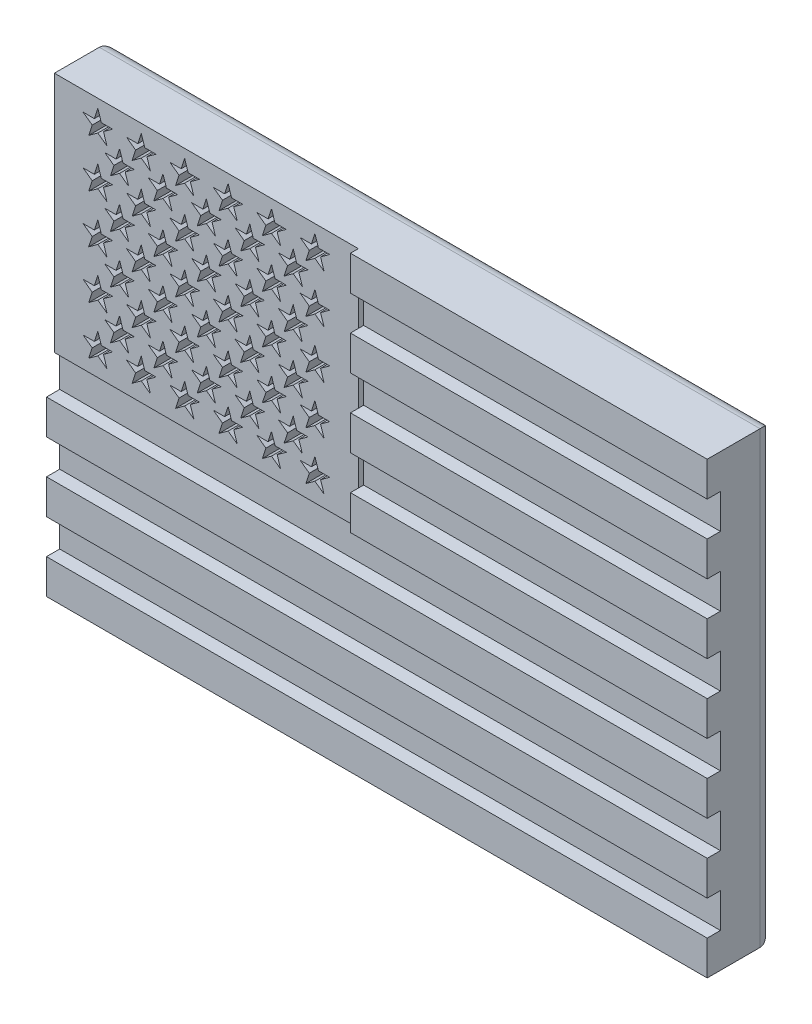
from build123d import *

# Parameters (mm, degrees)
SKETCH1_W           = 31.75
SKETCH1_H           = 21.59
BOSS_EXTRUDE1_DEPTH = 2.54
FILLET1_R           = 0.635
SKETCH2_W           = 17.145
SKETCH2_H           = 1.660769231
SKETCH2_H_2         = 1.66076923
SKETCH2_W_2         = 31.75
BOSS_EXTRUDE2_DEPTH = 0.635
SKETCH3_W           = 14.605
SKETCH3_H           = 11.625384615
BOSS_EXTRUDE3_DEPTH = 0.635
CUT_EXTRUDE1_DEPTH  = 1.905
CUT_EXTRUDE2_DEPTH  = 1.905
SKETCH6_W           = 14.605
SKETCH6_H           = 11.625384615
CUT_EXTRUDE3_DEPTH  = 0.381


with BuildPart() as part:
    # Sketch1 → Boss-Extrude1 (new body)
    with BuildSketch(Plane.XY):
        Rectangle(SKETCH1_W, SKETCH1_H)
    extrude(amount=BOSS_EXTRUDE1_DEPTH)

    # Fillet1
    fillet1_edges = [part.edges().sort_by_distance(p)[0] for p in [
        (0, -10.795, 0),
        (-15.875, 0, 0),
        (0, 10.795, 0),
        (15.875, 0, 0),
    ]]
    fillet(fillet1_edges, radius=FILLET1_R)

    # Sketch2 → Boss-Extrude2 (add)
    with BuildSketch(Plane.XY.offset(2.54)):
        with Locations((7.3025, 9.964615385)):
            Rectangle(SKETCH2_W, SKETCH2_H)
        with Locations((7.3025, 6.643076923)):
            Rectangle(SKETCH2_W, SKETCH2_H_2)
        with Locations((7.3025, 3.321538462)):
            Rectangle(SKETCH2_W, SKETCH2_H)
        with Locations((7.3025, 0)):
            Rectangle(SKETCH2_W, SKETCH2_H_2)
        with Locations((0, -3.321538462)):
            Rectangle(SKETCH2_W_2, SKETCH2_H)
        with Locations((0, -6.643076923)):
            Rectangle(SKETCH2_W_2, SKETCH2_H_2)
        with Locations((0, -9.964615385)):
            Rectangle(SKETCH2_W_2, SKETCH2_H)
    extrude(amount=BOSS_EXTRUDE2_DEPTH)

    # Sketch3 → Boss-Extrude3 (add)
    with BuildSketch(Plane.XY.offset(2.54)):
        with Locations((-8.5725, 4.982307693)):
            Rectangle(SKETCH3_W, SKETCH3_H)
    extrude(amount=BOSS_EXTRUDE3_DEPTH)

    # Sketch4 → Cut-Extrude1 (cut)
    with BuildSketch(Plane.XY.offset(3.175)):
        Polygon((-13.788571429, 10.378119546), (-13.955982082, 9.862882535), (-14.497734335, 9.862882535), (-14.059447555, 9.54444855), (-14.226858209, 9.029211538), (-13.788571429, 9.347645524), (-13.350284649, 9.029211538), (-13.517695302, 9.54444855), (-13.079408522, 9.862882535), (-13.621160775, 9.862882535), align=None)
        Polygon((-11.534732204, 9.862882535), (-11.702142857, 10.378119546), (-11.86955351, 9.862882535), (-12.411305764, 9.862882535), (-11.973018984, 9.54444855), (-12.140429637, 9.029211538), (-11.702142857, 9.347645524), (-11.263856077, 9.029211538), (-11.43126673, 9.54444855), (-10.99297995, 9.862882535), align=None)
        Polygon((-9.448303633, 9.862882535), (-9.615714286, 10.378119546), (-9.783124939, 9.862882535), (-10.324877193, 9.862882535), (-9.886590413, 9.54444855), (-10.054001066, 9.029211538), (-9.615714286, 9.347645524), (-9.177427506, 9.029211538), (-9.344838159, 9.54444855), (-8.906551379, 9.862882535), align=None)
        Polygon((-7.361875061, 9.862882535), (-7.529285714, 10.378119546), (-7.696696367, 9.862882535), (-8.238448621, 9.862882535), (-7.800161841, 9.54444855), (-7.967572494, 9.029211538), (-7.529285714, 9.347645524), (-7.090998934, 9.029211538), (-7.258409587, 9.54444855), (-6.820122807, 9.862882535), align=None)
        Polygon((-5.27544649, 9.862882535), (-5.442857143, 10.378119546), (-5.610267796, 9.862882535), (-6.15202005, 9.862882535), (-5.71373327, 9.54444855), (-5.881143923, 9.029211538), (-5.442857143, 9.347645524), (-5.004570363, 9.029211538), (-5.171981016, 9.54444855), (-4.733694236, 9.862882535), align=None)
        Polygon((-3.189017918, 9.862882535), (-3.356428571, 10.378119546), (-3.523839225, 9.862882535), (-4.065591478, 9.862882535), (-3.627304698, 9.54444855), (-3.794715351, 9.029211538), (-3.356428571, 9.347645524), (-2.918141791, 9.029211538), (-3.085552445, 9.54444855), (-2.647265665, 9.862882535), align=None)
        Polygon((-13.621160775, 7.544604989), (-13.788571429, 8.059842), (-13.955982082, 7.544604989), (-14.497734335, 7.544604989), (-14.059447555, 7.226171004), (-14.226858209, 6.710933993), (-13.788571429, 7.029367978), (-13.350284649, 6.710933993), (-13.517695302, 7.226171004), (-13.079408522, 7.544604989), align=None)
        Polygon((-11.534732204, 7.544604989), (-11.702142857, 8.059842), (-11.86955351, 7.544604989), (-12.411305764, 7.544604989), (-11.973018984, 7.226171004), (-12.140429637, 6.710933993), (-11.702142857, 7.029367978), (-11.263856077, 6.710933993), (-11.43126673, 7.226171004), (-10.99297995, 7.544604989), align=None)
        Polygon((-9.448303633, 7.544604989), (-9.615714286, 8.059842), (-9.783124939, 7.544604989), (-10.324877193, 7.544604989), (-9.886590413, 7.226171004), (-10.054001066, 6.710933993), (-9.615714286, 7.029367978), (-9.177427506, 6.710933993), (-9.344838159, 7.226171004), (-8.906551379, 7.544604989), align=None)
        Polygon((-7.361875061, 7.544604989), (-7.529285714, 8.059842), (-7.696696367, 7.544604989), (-8.238448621, 7.544604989), (-7.800161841, 7.226171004), (-7.967572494, 6.710933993), (-7.529285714, 7.029367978), (-7.090998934, 6.710933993), (-7.258409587, 7.226171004), (-6.820122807, 7.544604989), align=None)
        Polygon((-5.27544649, 7.544604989), (-5.442857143, 8.059842), (-5.610267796, 7.544604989), (-6.15202005, 7.544604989), (-5.71373327, 7.226171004), (-5.881143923, 6.710933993), (-5.442857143, 7.029367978), (-5.004570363, 6.710933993), (-5.171981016, 7.226171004), (-4.733694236, 7.544604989), align=None)
        Polygon((-3.189017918, 7.544604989), (-3.356428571, 8.059842), (-3.523839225, 7.544604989), (-4.065591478, 7.544604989), (-3.627304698, 7.226171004), (-3.794715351, 6.710933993), (-3.356428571, 7.029367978), (-2.918141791, 6.710933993), (-3.085552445, 7.226171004), (-2.647265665, 7.544604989), align=None)
        Polygon((-13.621160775, 5.226327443), (-13.788571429, 5.741564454), (-13.955982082, 5.226327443), (-14.497734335, 5.226327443), (-14.059447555, 4.907893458), (-14.226858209, 4.392656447), (-13.788571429, 4.711090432), (-13.350284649, 4.392656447), (-13.517695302, 4.907893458), (-13.079408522, 5.226327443), align=None)
        Polygon((-11.534732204, 5.226327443), (-11.702142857, 5.741564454), (-11.86955351, 5.226327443), (-12.411305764, 5.226327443), (-11.973018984, 4.907893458), (-12.140429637, 4.392656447), (-11.702142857, 4.711090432), (-11.263856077, 4.392656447), (-11.43126673, 4.907893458), (-10.99297995, 5.226327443), align=None)
        Polygon((-9.448303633, 5.226327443), (-9.615714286, 5.741564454), (-9.783124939, 5.226327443), (-10.324877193, 5.226327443), (-9.886590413, 4.907893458), (-10.054001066, 4.392656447), (-9.615714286, 4.711090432), (-9.177427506, 4.392656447), (-9.344838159, 4.907893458), (-8.906551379, 5.226327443), align=None)
        Polygon((-7.361875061, 5.226327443), (-7.529285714, 5.741564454), (-7.696696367, 5.226327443), (-8.238448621, 5.226327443), (-7.800161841, 4.907893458), (-7.967572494, 4.392656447), (-7.529285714, 4.711090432), (-7.090998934, 4.392656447), (-7.258409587, 4.907893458), (-6.820122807, 5.226327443), align=None)
        Polygon((-5.27544649, 5.226327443), (-5.442857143, 5.741564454), (-5.610267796, 5.226327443), (-6.15202005, 5.226327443), (-5.71373327, 4.907893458), (-5.881143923, 4.392656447), (-5.442857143, 4.711090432), (-5.004570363, 4.392656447), (-5.171981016, 4.907893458), (-4.733694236, 5.226327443), align=None)
        Polygon((-3.189017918, 5.226327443), (-3.356428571, 5.741564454), (-3.523839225, 5.226327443), (-4.065591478, 5.226327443), (-3.627304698, 4.907893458), (-3.794715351, 4.392656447), (-3.356428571, 4.711090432), (-2.918141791, 4.392656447), (-3.085552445, 4.907893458), (-2.647265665, 5.226327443), align=None)
        Polygon((-13.621160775, 2.908049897), (-13.788571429, 3.423286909), (-13.955982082, 2.908049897), (-14.497734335, 2.908049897), (-14.059447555, 2.589615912), (-14.226858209, 2.074378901), (-13.788571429, 2.392812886), (-13.350284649, 2.074378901), (-13.517695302, 2.589615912), (-13.079408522, 2.908049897), align=None)
        Polygon((-11.534732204, 2.908049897), (-11.702142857, 3.423286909), (-11.86955351, 2.908049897), (-12.411305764, 2.908049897), (-11.973018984, 2.589615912), (-12.140429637, 2.074378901), (-11.702142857, 2.392812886), (-11.263856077, 2.074378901), (-11.43126673, 2.589615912), (-10.99297995, 2.908049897), align=None)
        Polygon((-9.448303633, 2.908049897), (-9.615714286, 3.423286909), (-9.783124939, 2.908049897), (-10.324877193, 2.908049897), (-9.886590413, 2.589615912), (-10.054001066, 2.074378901), (-9.615714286, 2.392812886), (-9.177427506, 2.074378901), (-9.344838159, 2.589615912), (-8.906551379, 2.908049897), align=None)
        Polygon((-7.361875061, 2.908049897), (-7.529285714, 3.423286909), (-7.696696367, 2.908049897), (-8.238448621, 2.908049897), (-7.800161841, 2.589615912), (-7.967572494, 2.074378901), (-7.529285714, 2.392812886), (-7.090998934, 2.074378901), (-7.258409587, 2.589615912), (-6.820122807, 2.908049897), align=None)
        Polygon((-5.27544649, 2.908049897), (-5.442857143, 3.423286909), (-5.610267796, 2.908049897), (-6.15202005, 2.908049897), (-5.71373327, 2.589615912), (-5.881143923, 2.074378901), (-5.442857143, 2.392812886), (-5.004570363, 2.074378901), (-5.171981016, 2.589615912), (-4.733694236, 2.908049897), align=None)
        Polygon((-3.189017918, 2.908049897), (-3.356428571, 3.423286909), (-3.523839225, 2.908049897), (-4.065591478, 2.908049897), (-3.627304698, 2.589615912), (-3.794715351, 2.074378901), (-3.356428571, 2.392812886), (-2.918141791, 2.074378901), (-3.085552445, 2.589615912), (-2.647265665, 2.908049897), align=None)
        Polygon((-13.621160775, 0.589772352), (-13.788571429, 1.105009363), (-13.955982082, 0.589772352), (-14.497734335, 0.589772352), (-14.059447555, 0.271338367), (-14.226858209, -0.243898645), (-13.788571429, 0.074535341), (-13.350284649, -0.243898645), (-13.517695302, 0.271338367), (-13.079408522, 0.589772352), align=None)
        Polygon((-11.534732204, 0.589772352), (-11.702142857, 1.105009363), (-11.86955351, 0.589772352), (-12.411305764, 0.589772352), (-11.973018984, 0.271338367), (-12.140429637, -0.243898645), (-11.702142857, 0.074535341), (-11.263856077, -0.243898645), (-11.43126673, 0.271338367), (-10.99297995, 0.589772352), align=None)
        Polygon((-9.448303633, 0.589772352), (-9.615714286, 1.105009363), (-9.783124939, 0.589772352), (-10.324877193, 0.589772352), (-9.886590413, 0.271338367), (-10.054001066, -0.243898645), (-9.615714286, 0.074535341), (-9.177427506, -0.243898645), (-9.344838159, 0.271338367), (-8.906551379, 0.589772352), align=None)
        Polygon((-7.361875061, 0.589772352), (-7.529285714, 1.105009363), (-7.696696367, 0.589772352), (-8.238448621, 0.589772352), (-7.800161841, 0.271338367), (-7.967572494, -0.243898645), (-7.529285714, 0.074535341), (-7.090998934, -0.243898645), (-7.258409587, 0.271338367), (-6.820122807, 0.589772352), align=None)
        Polygon((-5.27544649, 0.589772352), (-5.442857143, 1.105009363), (-5.610267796, 0.589772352), (-6.15202005, 0.589772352), (-5.71373327, 0.271338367), (-5.881143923, -0.243898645), (-5.442857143, 0.074535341), (-5.004570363, -0.243898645), (-5.171981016, 0.271338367), (-4.733694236, 0.589772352), align=None)
        Polygon((-3.189017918, 0.589772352), (-3.356428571, 1.105009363), (-3.523839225, 0.589772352), (-4.065591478, 0.589772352), (-3.627304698, 0.271338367), (-3.794715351, -0.243898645), (-3.356428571, 0.074535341), (-2.918141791, -0.243898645), (-3.085552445, 0.271338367), (-2.647265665, 0.589772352), align=None)
    extrude(amount=-CUT_EXTRUDE1_DEPTH, mode=Mode.SUBTRACT)

    # Sketch5 → Cut-Extrude2 (cut)
    with BuildSketch(Plane.XY.offset(3.175)):
        Polygon((-12.912767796, 8.703743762), (-13.45452005, 8.703743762), (-13.01623327, 8.385309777), (-13.183643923, 7.870072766), (-12.745357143, 8.188506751), (-12.307070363, 7.870072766), (-12.474481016, 8.385309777), (-12.036194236, 8.703743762), (-12.57794649, 8.703743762), (-12.745357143, 9.218980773), align=None)
        Polygon((-10.826339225, 8.703743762), (-11.368091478, 8.703743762), (-10.929804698, 8.385309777), (-11.097215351, 7.870072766), (-10.658928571, 8.188506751), (-10.220641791, 7.870072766), (-10.388052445, 8.385309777), (-9.949765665, 8.703743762), (-10.491517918, 8.703743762), (-10.658928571, 9.218980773), align=None)
        Polygon((-8.739910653, 8.703743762), (-9.281662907, 8.703743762), (-8.843376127, 8.385309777), (-9.01078678, 7.870072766), (-8.5725, 8.188506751), (-8.13421322, 7.870072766), (-8.301623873, 8.385309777), (-7.863337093, 8.703743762), (-8.405089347, 8.703743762), (-8.5725, 9.218980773), align=None)
        Polygon((-6.653482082, 8.703743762), (-7.195234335, 8.703743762), (-6.756947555, 8.385309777), (-6.924358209, 7.870072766), (-6.486071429, 8.188506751), (-6.047784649, 7.870072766), (-6.215195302, 8.385309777), (-5.776908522, 8.703743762), (-6.318660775, 8.703743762), (-6.486071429, 9.218980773), align=None)
        Polygon((-4.56705351, 8.703743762), (-5.108805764, 8.703743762), (-4.670518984, 8.385309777), (-4.837929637, 7.870072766), (-4.399642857, 8.188506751), (-3.961356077, 7.870072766), (-4.12876673, 8.385309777), (-3.69047995, 8.703743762), (-4.232232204, 8.703743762), (-4.399642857, 9.218980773), align=None)
        Polygon((-12.912767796, 6.385466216), (-13.45452005, 6.385466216), (-13.01623327, 6.067032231), (-13.183643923, 5.55179522), (-12.745357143, 5.870229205), (-12.307070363, 5.55179522), (-12.474481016, 6.067032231), (-12.036194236, 6.385466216), (-12.57794649, 6.385466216), (-12.745357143, 6.900703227), align=None)
        Polygon((-10.826339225, 6.385466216), (-11.368091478, 6.385466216), (-10.929804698, 6.067032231), (-11.097215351, 5.55179522), (-10.658928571, 5.870229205), (-10.220641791, 5.55179522), (-10.388052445, 6.067032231), (-9.949765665, 6.385466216), (-10.491517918, 6.385466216), (-10.658928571, 6.900703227), align=None)
        Polygon((-8.739910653, 6.385466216), (-9.281662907, 6.385466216), (-8.843376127, 6.067032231), (-9.01078678, 5.55179522), (-8.5725, 5.870229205), (-8.13421322, 5.55179522), (-8.301623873, 6.067032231), (-7.863337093, 6.385466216), (-8.405089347, 6.385466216), (-8.5725, 6.900703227), align=None)
        Polygon((-6.653482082, 6.385466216), (-7.195234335, 6.385466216), (-6.756947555, 6.067032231), (-6.924358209, 5.55179522), (-6.486071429, 5.870229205), (-6.047784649, 5.55179522), (-6.215195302, 6.067032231), (-5.776908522, 6.385466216), (-6.318660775, 6.385466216), (-6.486071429, 6.900703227), align=None)
        Polygon((-4.56705351, 6.385466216), (-5.108805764, 6.385466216), (-4.670518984, 6.067032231), (-4.837929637, 5.55179522), (-4.399642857, 5.870229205), (-3.961356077, 5.55179522), (-4.12876673, 6.067032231), (-3.69047995, 6.385466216), (-4.232232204, 6.385466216), (-4.399642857, 6.900703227), align=None)
        Polygon((-12.912767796, 4.06718867), (-13.45452005, 4.06718867), (-13.01623327, 3.748754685), (-13.183643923, 3.233517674), (-12.745357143, 3.551951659), (-12.307070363, 3.233517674), (-12.474481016, 3.748754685), (-12.036194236, 4.06718867), (-12.57794649, 4.06718867), (-12.745357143, 4.582425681), align=None)
        Polygon((-10.826339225, 4.06718867), (-11.368091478, 4.06718867), (-10.929804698, 3.748754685), (-11.097215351, 3.233517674), (-10.658928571, 3.551951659), (-10.220641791, 3.233517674), (-10.388052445, 3.748754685), (-9.949765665, 4.06718867), (-10.491517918, 4.06718867), (-10.658928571, 4.582425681), align=None)
        Polygon((-8.739910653, 4.06718867), (-9.281662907, 4.06718867), (-8.843376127, 3.748754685), (-9.01078678, 3.233517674), (-8.5725, 3.551951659), (-8.13421322, 3.233517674), (-8.301623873, 3.748754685), (-7.863337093, 4.06718867), (-8.405089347, 4.06718867), (-8.5725, 4.582425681), align=None)
        Polygon((-6.653482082, 4.06718867), (-7.195234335, 4.06718867), (-6.756947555, 3.748754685), (-6.924358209, 3.233517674), (-6.486071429, 3.551951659), (-6.047784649, 3.233517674), (-6.215195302, 3.748754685), (-5.776908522, 4.06718867), (-6.318660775, 4.06718867), (-6.486071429, 4.582425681), align=None)
        Polygon((-4.56705351, 4.06718867), (-5.108805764, 4.06718867), (-4.670518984, 3.748754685), (-4.837929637, 3.233517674), (-4.399642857, 3.551951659), (-3.961356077, 3.233517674), (-4.12876673, 3.748754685), (-3.69047995, 4.06718867), (-4.232232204, 4.06718867), (-4.399642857, 4.582425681), align=None)
        Polygon((-12.912767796, 1.748911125), (-13.45452005, 1.748911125), (-13.01623327, 1.430477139), (-13.183643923, 0.915240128), (-12.745357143, 1.233674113), (-12.307070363, 0.915240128), (-12.474481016, 1.430477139), (-12.036194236, 1.748911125), (-12.57794649, 1.748911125), (-12.745357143, 2.264148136), align=None)
        Polygon((-10.826339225, 1.748911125), (-11.368091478, 1.748911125), (-10.929804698, 1.430477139), (-11.097215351, 0.915240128), (-10.658928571, 1.233674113), (-10.220641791, 0.915240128), (-10.388052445, 1.430477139), (-9.949765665, 1.748911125), (-10.491517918, 1.748911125), (-10.658928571, 2.264148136), align=None)
        Polygon((-8.739910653, 1.748911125), (-9.281662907, 1.748911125), (-8.843376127, 1.430477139), (-9.01078678, 0.915240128), (-8.5725, 1.233674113), (-8.13421322, 0.915240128), (-8.301623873, 1.430477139), (-7.863337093, 1.748911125), (-8.405089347, 1.748911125), (-8.5725, 2.264148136), align=None)
        Polygon((-6.653482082, 1.748911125), (-7.195234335, 1.748911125), (-6.756947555, 1.430477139), (-6.924358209, 0.915240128), (-6.486071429, 1.233674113), (-6.047784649, 0.915240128), (-6.215195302, 1.430477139), (-5.776908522, 1.748911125), (-6.318660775, 1.748911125), (-6.486071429, 2.264148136), align=None)
        Polygon((-4.56705351, 1.748911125), (-5.108805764, 1.748911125), (-4.670518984, 1.430477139), (-4.837929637, 0.915240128), (-4.399642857, 1.233674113), (-3.961356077, 0.915240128), (-4.12876673, 1.430477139), (-3.69047995, 1.748911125), (-4.232232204, 1.748911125), (-4.399642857, 2.264148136), align=None)
    extrude(amount=-CUT_EXTRUDE2_DEPTH, mode=Mode.SUBTRACT)

    # Sketch6 → Cut-Extrude3 (cut)
    with BuildSketch(Plane.XY.offset(3.175)):
        with Locations((-8.5725, 4.982307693)):
            Rectangle(SKETCH6_W, SKETCH6_H)
    extrude(amount=-CUT_EXTRUDE3_DEPTH, mode=Mode.SUBTRACT)


solid = part.part
